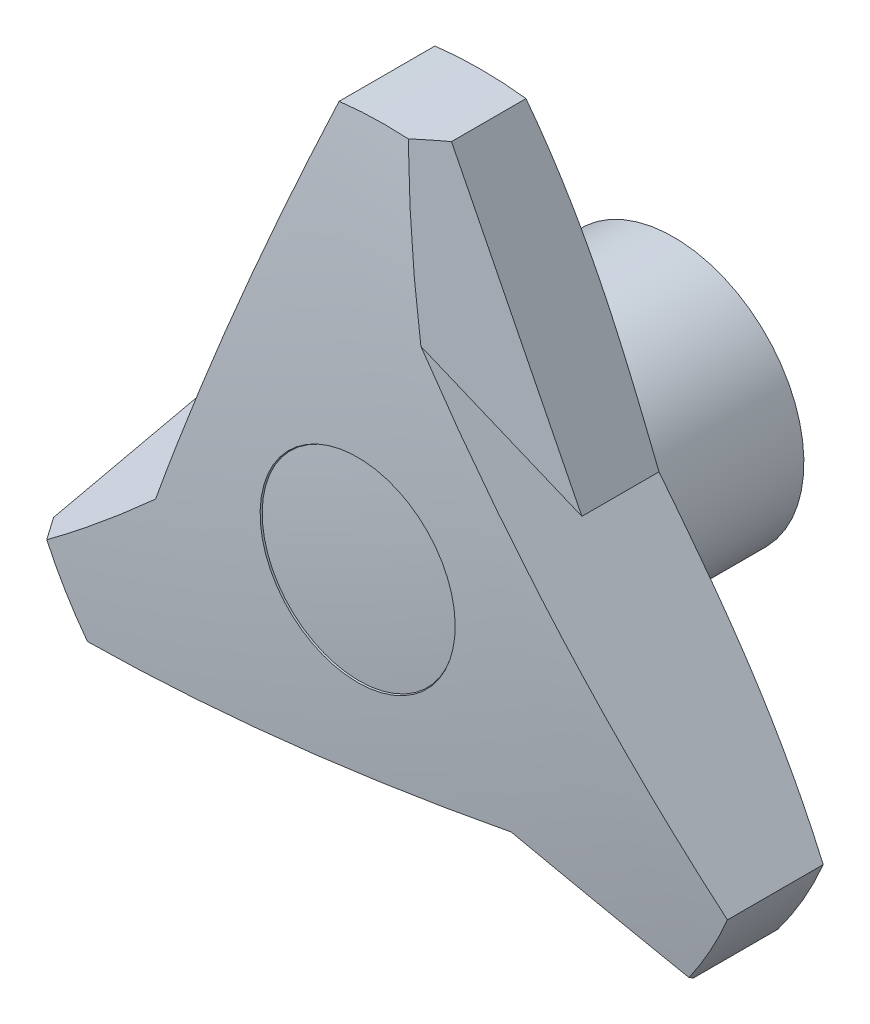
ISO-10303-21;
HEADER;
FILE_DESCRIPTION(('STEP AP214'),'2;1');
FILE_NAME('part.step','',(''),(''),'','','');
FILE_SCHEMA(('AUTOMOTIVE_DESIGN { 1 0 10303 214 1 1 1 1 }'));
ENDSEC;
DATA;
#1=APPLICATION_CONTEXT('core data for automotive mechanical design processes');
#2=APPLICATION_PROTOCOL_DEFINITION('international standard','automotive_design',2000,#1);
#3=PRODUCT_CONTEXT('',#1,'mechanical');
#4=PRODUCT('Part','Part','',(#3));
#5=PRODUCT_RELATED_PRODUCT_CATEGORY('part','',(#4));
#6=PRODUCT_DEFINITION_FORMATION('','',#4);
#7=PRODUCT_DEFINITION_CONTEXT('part definition',#1,'design');
#8=PRODUCT_DEFINITION('design','',#6,#7);
#9=PRODUCT_DEFINITION_SHAPE('','',#8);
#10=(LENGTH_UNIT() NAMED_UNIT(*) SI_UNIT(.MILLI.,.METRE.));
#11=(NAMED_UNIT(*) PLANE_ANGLE_UNIT() SI_UNIT($,.RADIAN.));
#12=(NAMED_UNIT(*) SI_UNIT($,.STERADIAN.) SOLID_ANGLE_UNIT());
#13=UNCERTAINTY_MEASURE_WITH_UNIT(LENGTH_MEASURE(1.E-05),#10,'distance_accuracy_value','');
#14=(GEOMETRIC_REPRESENTATION_CONTEXT(3) GLOBAL_UNCERTAINTY_ASSIGNED_CONTEXT((#13)) GLOBAL_UNIT_ASSIGNED_CONTEXT((#10,
#11,#12)) REPRESENTATION_CONTEXT('',''));
#15=CARTESIAN_POINT('',(0.,0.,0.));
#16=DIRECTION('',(0.,0.,1.));
#17=DIRECTION('',(1.,0.,0.));
#18=AXIS2_PLACEMENT_3D('',#15,#16,#17);
#19=CARTESIAN_POINT('',(0.,-9.85756615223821E-13,-147.000000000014));
#20=DIRECTION('',(0.,1.,0.));
#21=DIRECTION('',(1.,0.,0.));
#22=AXIS2_PLACEMENT_3D('',#19,#20,#21);
#23=SPHERICAL_SURFACE('',#22,190.);
#24=CARTESIAN_POINT('',(0.,0.,42.5547414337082));
#25=DIRECTION('',(0.,0.,1.));
#26=DIRECTION('',(0.,-1.,0.));
#27=AXIS2_PLACEMENT_3D('',#24,#25,#26);
#28=CIRCLE('',#27,13.);
#29=CARTESIAN_POINT('',(0.,-13.,42.5547414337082));
#30=VERTEX_POINT('',#29);
#31=EDGE_CURVE('E265',#30,#30,#28,.F.);
#32=ORIENTED_EDGE('',*,*,#31,.F.);
#33=EDGE_LOOP('',(#32));
#34=FACE_BOUND('',#33,.T.);
#35=ADVANCED_FACE('F15',(#34),#23,.T.);
#36=CARTESIAN_POINT('',(0.,0.,40.));
#37=DIRECTION('',(0.,0.,1.));
#38=DIRECTION('',(0.,-1.,0.));
#39=AXIS2_PLACEMENT_3D('',#36,#37,#38);
#40=CYLINDRICAL_SURFACE('',#39,13.);
#41=ORIENTED_EDGE('',*,*,#31,.T.);
#42=EDGE_LOOP('',(#41));
#43=FACE_BOUND('',#42,.T.);
#44=CARTESIAN_POINT('',(0.,0.,40.));
#45=DIRECTION('',(0.,0.,1.));
#46=DIRECTION('',(0.,-1.,0.));
#47=AXIS2_PLACEMENT_3D('',#44,#45,#46);
#48=CIRCLE('',#47,13.);
#49=CARTESIAN_POINT('',(0.,-13.,40.));
#50=VERTEX_POINT('',#49);
#51=EDGE_CURVE('E263',#50,#50,#48,.F.);
#52=ORIENTED_EDGE('',*,*,#51,.F.);
#53=EDGE_LOOP('',(#52));
#54=FACE_BOUND('',#53,.T.);
#55=ADVANCED_FACE('F608',(#43,#54),#40,.T.);
#56=CARTESIAN_POINT('',(0.,13.1,40.));
#57=DIRECTION('',(0.,0.,1.));
#58=DIRECTION('',(0.,-1.,0.));
#59=AXIS2_PLACEMENT_3D('',#56,#57,#58);
#60=PLANE('',#59);
#61=CARTESIAN_POINT('',(0.,0.,40.));
#62=DIRECTION('',(0.,0.,1.));
#63=DIRECTION('',(0.,-1.,0.));
#64=AXIS2_PLACEMENT_3D('',#61,#62,#63);
#65=CIRCLE('',#64,13.1);
#66=CARTESIAN_POINT('',(0.,-13.1,40.));
#67=VERTEX_POINT('',#66);
#68=EDGE_CURVE('E260',#67,#67,#65,.T.);
#69=ORIENTED_EDGE('',*,*,#68,.T.);
#70=EDGE_LOOP('',(#69));
#71=FACE_BOUND('',#70,.T.);
#72=ORIENTED_EDGE('',*,*,#51,.T.);
#73=EDGE_LOOP('',(#72));
#74=FACE_BOUND('',#73,.T.);
#75=ADVANCED_FACE('F431',(#71,#74),#60,.T.);
#76=CARTESIAN_POINT('',(8.4,0.,0.));
#77=DIRECTION('',(0.,0.,1.));
#78=DIRECTION('',(0.,-1.,0.));
#79=AXIS2_PLACEMENT_3D('',#76,#77,#78);
#80=PLANE('',#79);
#81=CARTESIAN_POINT('',(0.,0.,0.));
#82=DIRECTION('',(0.,0.,1.));
#83=DIRECTION('',(0.,-1.,0.));
#84=AXIS2_PLACEMENT_3D('',#81,#82,#83);
#85=CIRCLE('',#84,8.4);
#86=CARTESIAN_POINT('',(0.,-8.4,0.));
#87=VERTEX_POINT('',#86);
#88=EDGE_CURVE('E257',#87,#87,#85,.T.);
#89=ORIENTED_EDGE('',*,*,#88,.F.);
#90=EDGE_LOOP('',(#89));
#91=FACE_BOUND('',#90,.T.);
#92=CARTESIAN_POINT('',(0.,0.,0.));
#93=DIRECTION('',(0.,0.,-1.));
#94=DIRECTION('',(0.,1.,0.));
#95=AXIS2_PLACEMENT_3D('',#92,#93,#94);
#96=CIRCLE('',#95,5.99999999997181);
#97=CARTESIAN_POINT('',(0.,5.99999999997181,0.));
#98=VERTEX_POINT('',#97);
#99=EDGE_CURVE('E274',#98,#98,#96,.T.);
#100=ORIENTED_EDGE('',*,*,#99,.F.);
#101=EDGE_LOOP('',(#100));
#102=FACE_BOUND('',#101,.T.);
#103=ADVANCED_FACE('F428',(#91,#102),#80,.F.);
#104=CARTESIAN_POINT('',(0.,0.,40.));
#105=DIRECTION('',(0.,0.,1.));
#106=DIRECTION('',(0.,-1.,0.));
#107=AXIS2_PLACEMENT_3D('',#104,#105,#106);
#108=CYLINDRICAL_SURFACE('',#107,13.1);
#109=CARTESIAN_POINT('',(0.,0.,42.7342405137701));
#110=DIRECTION('',(0.,0.,1.));
#111=DIRECTION('',(0.,-1.,0.));
#112=AXIS2_PLACEMENT_3D('',#109,#110,#111);
#113=CIRCLE('',#112,13.1);
#114=CARTESIAN_POINT('',(0.,-13.1,42.7342405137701));
#115=VERTEX_POINT('',#114);
#116=EDGE_CURVE('E226',#115,#115,#113,.F.);
#117=ORIENTED_EDGE('',*,*,#116,.F.);
#118=EDGE_LOOP('',(#117));
#119=FACE_BOUND('',#118,.T.);
#120=ORIENTED_EDGE('',*,*,#68,.F.);
#121=EDGE_LOOP('',(#120));
#122=FACE_BOUND('',#121,.T.);
#123=ADVANCED_FACE('F425',(#119,#122),#108,.F.);
#124=CARTESIAN_POINT('',(0.,0.,0.));
#125=DIRECTION('',(0.,0.,1.));
#126=DIRECTION('',(0.,-1.,0.));
#127=AXIS2_PLACEMENT_3D('',#124,#125,#126);
#128=CYLINDRICAL_SURFACE('',#127,8.4);
#129=CARTESIAN_POINT('',(0.,0.,0.3));
#130=DIRECTION('',(0.,0.,1.));
#131=DIRECTION('',(0.,-1.,0.));
#132=AXIS2_PLACEMENT_3D('',#129,#130,#131);
#133=CIRCLE('',#132,8.4);
#134=CARTESIAN_POINT('',(0.,-8.4,0.3));
#135=VERTEX_POINT('',#134);
#136=EDGE_CURVE('E213',#135,#135,#133,.F.);
#137=ORIENTED_EDGE('',*,*,#136,.T.);
#138=EDGE_LOOP('',(#137));
#139=FACE_BOUND('',#138,.T.);
#140=ORIENTED_EDGE('',*,*,#88,.T.);
#141=EDGE_LOOP('',(#140));
#142=FACE_BOUND('',#141,.T.);
#143=ADVANCED_FACE('F250',(#139,#142),#128,.T.);
#144=CARTESIAN_POINT('',(27.7270975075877,8.91544882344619,27.7270975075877));
#145=DIRECTION('',(0.689509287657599,0.221706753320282,0.689509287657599));
#146=DIRECTION('',(-0.707106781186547,0.,0.707106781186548));
#147=AXIS2_PLACEMENT_3D('',#144,#145,#146);
#148=PLANE('',#147);
#149=DIRECTION('',(-0.583653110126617,0.733790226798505,0.347708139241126));
#150=VECTOR('',#149,1.);
#151=CARTESIAN_POINT('',(20.9107128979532,12.0728057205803,33.5282567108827));
#152=LINE('',#151,#150);
#153=CARTESIAN_POINT('',(20.9107128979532,12.0728057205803,33.5282567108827));
#154=VERTEX_POINT('',#153);
#155=CARTESIAN_POINT('',(7.35939895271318,29.110017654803,41.6013776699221));
#156=VERTEX_POINT('',#155);
#157=EDGE_CURVE('E208',#154,#156,#152,.T.);
#158=ORIENTED_EDGE('',*,*,#157,.F.);
#159=DIRECTION('',(0.365695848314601,-0.928304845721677,-0.0672061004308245));
#160=VECTOR('',#159,1.);
#161=CARTESIAN_POINT('',(6.11768916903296,49.6243274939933,36.2468586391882));
#162=LINE('',#161,#160);
#163=CARTESIAN_POINT('',(6.11768916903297,49.6243274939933,36.2468586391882));
#164=VERTEX_POINT('',#163);
#165=EDGE_CURVE('E104',#164,#154,#162,.T.);
#166=ORIENTED_EDGE('',*,*,#165,.F.);
#167=CARTESIAN_POINT('',(0.,0.,58.3208934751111));
#168=DIRECTION('',(0.689509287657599,0.221706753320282,0.689509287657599));
#169=DIRECTION('',(-0.656410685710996,-0.211064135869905,0.72427684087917));
#170=AXIS2_PLACEMENT_3D('',#167,#168,#169);
#171=ELLIPSE('',#170,72.5153393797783,50.);
#172=CARTESIAN_POINT('',(3.16952203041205,49.8994401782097,39.1065652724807));
#173=VERTEX_POINT('',#172);
#174=EDGE_CURVE('E210',#173,#164,#171,.F.);
#175=ORIENTED_EDGE('',*,*,#174,.F.);
#176=CARTESIAN_POINT('',(7.35939895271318,29.110017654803,41.6013776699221));
#177=CARTESIAN_POINT('',(7.22325188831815,29.6858443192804,41.552371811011));
#178=CARTESIAN_POINT('',(7.08873095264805,30.2619105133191,41.501662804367));
#179=CARTESIAN_POINT('',(6.82299189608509,31.414302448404,41.3968585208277));
#180=CARTESIAN_POINT('',(6.69177274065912,31.9906280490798,41.3427643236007));
#181=CARTESIAN_POINT('',(6.43263427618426,33.1435384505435,41.2311927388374));
#182=CARTESIAN_POINT('',(6.30471413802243,33.7201231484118,41.1737162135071));
#183=CARTESIAN_POINT('',(6.05217130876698,34.8735514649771,41.0553824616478));
#184=CARTESIAN_POINT('',(5.9275479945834,35.4503950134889,40.9945258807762));
#185=CARTESIAN_POINT('',(5.681597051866,36.6043408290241,40.8694338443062));
#186=CARTESIAN_POINT('',(5.56026900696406,37.1814430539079,40.8051988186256));
#187=CARTESIAN_POINT('',(5.32090745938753,38.3359060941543,40.6733510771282));
#188=CARTESIAN_POINT('',(5.20287374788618,38.9132668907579,40.6057385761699));
#189=CARTESIAN_POINT('',(4.9701003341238,40.0682470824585,40.4671364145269));
#190=CARTESIAN_POINT('',(4.85536063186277,40.6458664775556,40.3961467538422));
#191=CARTESIAN_POINT('',(4.6291753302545,41.801363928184,40.2507901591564));
#192=CARTESIAN_POINT('',(4.51772994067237,42.3792419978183,40.1764230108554));
#193=CARTESIAN_POINT('',(4.29813400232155,43.5352568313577,40.0243106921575));
#194=CARTESIAN_POINT('',(4.18998387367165,44.1133936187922,39.9465650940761));
#195=CARTESIAN_POINT('',(3.97697982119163,45.2699259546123,39.7876944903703));
#196=CARTESIAN_POINT('',(3.87212652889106,45.8483215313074,39.7065688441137));
#197=CARTESIAN_POINT('',(3.6657181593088,47.0053715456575,39.5409361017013));
#198=CARTESIAN_POINT('',(3.56416392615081,47.5840260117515,39.4564281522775));
#199=CARTESIAN_POINT('',(3.36435626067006,48.7415939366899,39.2840281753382));
#200=CARTESIAN_POINT('',(3.26610388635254,49.3205074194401,39.1961350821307));
#201=CARTESIAN_POINT('',(3.16952203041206,49.8994401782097,39.1065652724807));
#202=B_SPLINE_CURVE_WITH_KNOTS('',3,(#176,#177,#178,#179,#180,#181,#182,#183,#184,#185,#186,
#187,#188,#189,#190,#191,#192,#193,#194,#195,#196,#197,#198,#199,#200,#201),.UNSPECIFIED.,.F.,
.F.,(4,2,2,2,2,2,2,2,2,2,2,2,4),(0.,1.78118182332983,3.56179842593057,5.34196307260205,
7.12178883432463,8.90138865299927,10.6808754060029,12.4603621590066,14.2399619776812,
16.0197877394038,17.7999523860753,19.580568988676,21.3617508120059),.UNSPECIFIED.);
#203=EDGE_CURVE('E97',#156,#173,#202,.T.);
#204=ORIENTED_EDGE('',*,*,#203,.F.);
#205=EDGE_LOOP('',(#158,#166,#175,#204));
#206=FACE_BOUND('',#205,.T.);
#207=ADVANCED_FACE('F245',(#206),#148,.T.);
#208=CARTESIAN_POINT('',(-6.72657122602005,-28.4671747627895,28.016582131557));
#209=DIRECTION('',(-0.166072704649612,-0.702827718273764,0.691703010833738));
#210=DIRECTION('',(0.,-0.701443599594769,-0.712724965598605));
#211=AXIS2_PLACEMENT_3D('',#208,#209,#210);
#212=PLANE('',#211);
#213=DIRECTION('',(0.922166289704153,0.13779507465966,0.361416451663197));
#214=VECTOR('',#213,1.);
#215=CARTESIAN_POINT('',(0.,-24.1456114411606,34.0226487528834));
#216=LINE('',#215,#214);
#217=CARTESIAN_POINT('',(0.,-24.1456114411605,34.0226487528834));
#218=VERTEX_POINT('',#217);
#219=CARTESIAN_POINT('',(19.6035989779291,-21.216335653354,41.7057133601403));
#220=VERTEX_POINT('',#219);
#221=EDGE_CURVE('E333',#218,#220,#216,.T.);
#222=ORIENTED_EDGE('',*,*,#221,.F.);
#223=DIRECTION('',(-0.985272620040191,0.147224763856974,-0.086963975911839));
#224=VECTOR('',#223,1.);
#225=CARTESIAN_POINT('',(39.9170836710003,-30.1102379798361,37.5458850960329));
#226=LINE('',#225,#224);
#227=CARTESIAN_POINT('',(39.9170836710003,-30.1102379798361,37.5458850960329));
#228=VERTEX_POINT('',#227);
#229=EDGE_CURVE('E198',#228,#218,#226,.T.);
#230=ORIENTED_EDGE('',*,*,#229,.F.);
#231=CARTESIAN_POINT('',(40.8724756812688,-28.800012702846,39.1065652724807));
#232=CARTESIAN_POINT('',(40.8331343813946,-28.8558451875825,39.0403892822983));
#233=CARTESIAN_POINT('',(40.7936629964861,-28.9116193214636,38.9742413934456));
#234=CARTESIAN_POINT('',(40.7146174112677,-29.0228283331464,38.8422656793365));
#235=CARTESIAN_POINT('',(40.6750442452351,-29.0782636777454,38.7764376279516));
#236=CARTESIAN_POINT('',(40.5957979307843,-29.1887957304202,38.6451015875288));
#237=CARTESIAN_POINT('',(40.5561258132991,-29.2438929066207,38.5795933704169));
#238=CARTESIAN_POINT('',(40.4766844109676,-29.3537492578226,38.4488970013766));
#239=CARTESIAN_POINT('',(40.4369161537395,-29.4085089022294,38.3837086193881));
#240=CARTESIAN_POINT('',(40.357285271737,-29.5176908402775,38.2536519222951));
#241=CARTESIAN_POINT('',(40.3174236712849,-29.5721136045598,38.1887833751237));
#242=CARTESIAN_POINT('',(40.237608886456,-29.6806224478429,38.0593663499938));
#243=CARTESIAN_POINT('',(40.1976567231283,-29.7347089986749,37.9948176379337));
#244=CARTESIAN_POINT('',(40.117663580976,-29.8425460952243,37.8660402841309));
#245=CARTESIAN_POINT('',(40.0776236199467,-29.8962971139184,37.8018114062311));
#246=CARTESIAN_POINT('',(39.9974576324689,-30.003463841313,37.6736737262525));
#247=CARTESIAN_POINT('',(39.957332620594,-30.0568800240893,37.6097646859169));
#248=CARTESIAN_POINT('',(39.9170836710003,-30.1102379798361,37.5458850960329));
#249=B_SPLINE_CURVE_WITH_KNOTS('',3,(#231,#232,#233,#234,#235,#236,#237,#238,#239,#240,#241,
#242,#243,#244,#245,#246,#247,#248),.UNSPECIFIED.,.F.,.F.,(4,2,2,2,2,2,2,2,4),(0.,
0.285303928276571,0.569472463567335,0.852505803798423,1.13440414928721,1.41516770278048,
1.69479666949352,1.97329125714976,2.25065167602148),.UNSPECIFIED.);
#250=CARTESIAN_POINT('',(40.8724756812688,-28.8000127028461,39.1065652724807));
#251=VERTEX_POINT('',#250);
#252=EDGE_CURVE('E336',#251,#228,#249,.T.);
#253=ORIENTED_EDGE('',*,*,#252,.F.);
#254=CARTESIAN_POINT('',(19.6035989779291,-21.216335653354,41.7057133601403));
#255=CARTESIAN_POINT('',(20.2043265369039,-21.4066629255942,41.6565552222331));
#256=CARTESIAN_POINT('',(20.8043457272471,-21.5987264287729,41.6054628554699));
#257=CARTESIAN_POINT('',(22.0027065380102,-21.986241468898,41.4994328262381));
#258=CARTESIAN_POINT('',(22.6010486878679,-22.1816917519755,41.4444965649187));
#259=CARTESIAN_POINT('',(23.7960570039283,-22.5759767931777,41.3307827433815));
#260=CARTESIAN_POINT('',(24.3927236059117,-22.7748105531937,41.2720063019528));
#261=CARTESIAN_POINT('',(25.5843821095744,-23.1758596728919,41.1506153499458));
#262=CARTESIAN_POINT('',(26.1793743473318,-23.3780742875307,41.0880016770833));
#263=CARTESIAN_POINT('',(27.3676850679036,-23.785883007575,40.9589386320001));
#264=CARTESIAN_POINT('',(27.961003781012,-23.9914766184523,40.892489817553));
#265=CARTESIAN_POINT('',(29.1459680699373,-24.4060419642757,40.7557580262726));
#266=CARTESIAN_POINT('',(29.7376137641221,-24.6150134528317,40.6854753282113));
#267=CARTESIAN_POINT('',(30.9192323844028,-25.0363339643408,40.5410764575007));
#268=CARTESIAN_POINT('',(31.5092053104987,-25.2486829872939,40.4669602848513));
#269=CARTESIAN_POINT('',(32.687478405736,-25.6767587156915,40.3148943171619));
#270=CARTESIAN_POINT('',(33.2757784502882,-25.8924856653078,40.2369442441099));
#271=CARTESIAN_POINT('',(34.4507053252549,-26.3273180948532,40.0772095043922));
#272=CARTESIAN_POINT('',(35.0373319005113,-26.5464240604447,39.9954242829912));
#273=CARTESIAN_POINT('',(36.2089109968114,-26.9880160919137,39.8280174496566));
#274=CARTESIAN_POINT('',(36.7938631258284,-27.2105028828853,39.7423950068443));
#275=CARTESIAN_POINT('',(37.9620920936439,-27.6588588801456,39.567311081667));
#276=CARTESIAN_POINT('',(38.5453683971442,-27.8847290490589,39.4778484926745));
#277=CARTESIAN_POINT('',(39.7102441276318,-28.3398547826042,39.2950808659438));
#278=CARTESIAN_POINT('',(40.29184286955,-28.569111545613,39.2017744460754));
#279=CARTESIAN_POINT('',(40.8724756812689,-28.8000127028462,39.1065652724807));
#280=B_SPLINE_CURVE_WITH_KNOTS('',3,(#254,#255,#256,#257,#258,#259,#260,#261,#262,#263,#264,
#265,#266,#267,#268,#269,#270,#271,#272,#273,#274,#275,#276,#277,#278,#279),.UNSPECIFIED.,.F.,
.F.,(4,2,2,2,2,2,2,2,2,2,2,2,4),(0.,1.8962092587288,3.79173088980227,5.68670272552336,
7.58126232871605,9.47554708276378,11.3696942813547,13.2638414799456,15.1581262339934,
17.0526858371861,18.9476576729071,20.8431793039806,22.7393885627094),.UNSPECIFIED.);
#281=EDGE_CURVE('E229',#220,#251,#280,.T.);
#282=ORIENTED_EDGE('',*,*,#281,.F.);
#283=EDGE_LOOP('',(#222,#230,#253,#282));
#284=FACE_BOUND('',#283,.T.);
#285=ADVANCED_FACE('F241',(#284),#212,.T.);
#286=CARTESIAN_POINT('',(-21.2900109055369,20.0589689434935,28.016582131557));
#287=DIRECTION('',(-0.525630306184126,0.495237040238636,0.691703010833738));
#288=DIRECTION('',(-0.796197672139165,0.,-0.60503658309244));
#289=AXIS2_PLACEMENT_3D('',#286,#287,#288);
#290=PLANE('',#289);
#291=DIRECTION('',(-0.341749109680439,-0.867516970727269,0.36141645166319));
#292=VECTOR('',#291,1.);
#293=CARTESIAN_POINT('',(-20.9107128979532,12.0728057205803,34.0226487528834));
#294=LINE('',#293,#292);
#295=CARTESIAN_POINT('',(-20.9107128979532,12.0728057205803,34.0226487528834));
#296=VERTEX_POINT('',#295);
#297=CARTESIAN_POINT('',(-28.1756851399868,-6.36904689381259,41.7057133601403));
#298=VERTEX_POINT('',#297);
#299=EDGE_CURVE('E172',#296,#298,#294,.T.);
#300=ORIENTED_EDGE('',*,*,#299,.F.);
#301=DIRECTION('',(0.620136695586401,0.779658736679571,-0.086963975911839));
#302=VECTOR('',#301,1.);
#303=CARTESIAN_POINT('',(-46.0347728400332,-19.5140895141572,37.5458850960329));
#304=LINE('',#303,#302);
#305=CARTESIAN_POINT('',(-46.0347728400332,-19.5140895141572,37.5458850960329));
#306=VERTEX_POINT('',#305);
#307=EDGE_CURVE('E131',#306,#296,#304,.T.);
#308=ORIENTED_EDGE('',*,*,#307,.F.);
#309=CARTESIAN_POINT('',(-45.3777804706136,-20.9965959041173,39.1065652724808));
#310=CARTESIAN_POINT('',(-45.4064621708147,-20.93460909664,39.0403892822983));
#311=CARTESIAN_POINT('',(-45.4350282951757,-20.8725388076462,38.9742413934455));
#312=CARTESIAN_POINT('',(-45.4918153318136,-20.7484788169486,38.8422656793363));
#313=CARTESIAN_POINT('',(-45.5200371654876,-20.6864897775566,38.7764376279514));
#314=CARTESIAN_POINT('',(-45.576137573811,-20.5625944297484,38.6451015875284));
#315=CARTESIAN_POINT('',(-45.6040170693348,-20.5006887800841,38.5795933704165));
#316=CARTESIAN_POINT('',(-45.659434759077,-20.3769623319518,38.4488970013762));
#317=CARTESIAN_POINT('',(-45.6869738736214,-20.3151421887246,38.3837086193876));
#318=CARTESIAN_POINT('',(-45.7417127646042,-20.1915888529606,38.2536519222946));
#319=CARTESIAN_POINT('',(-45.7689134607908,-20.1298563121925,38.1887833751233));
#320=CARTESIAN_POINT('',(-45.8229774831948,-20.0064802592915,38.0593663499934));
#321=CARTESIAN_POINT('',(-45.8498417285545,-19.9448373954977,37.9948176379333));
#322=CARTESIAN_POINT('',(-45.9032348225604,-19.8216427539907,37.8660402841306));
#323=CARTESIAN_POINT('',(-45.9297645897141,-19.7600916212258,37.8018114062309));
#324=CARTESIAN_POINT('',(-45.9824907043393,-19.6370824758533,37.6736737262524));
#325=CARTESIAN_POINT('',(-46.0086879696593,-19.5756251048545,37.6097646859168));
#326=CARTESIAN_POINT('',(-46.0347728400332,-19.5140895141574,37.5458850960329));
#327=B_SPLINE_CURVE_WITH_KNOTS('',3,(#309,#310,#311,#312,#313,#314,#315,#316,#317,#318,#319,
#320,#321,#322,#323,#324,#325,#326),.UNSPECIFIED.,.F.,.F.,(4,2,2,2,2,2,2,2,4),(0.,
0.285303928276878,0.56947246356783,0.852505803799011,1.13440414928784,1.41516770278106,
1.69479666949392,1.97329125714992,2.25065167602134),.UNSPECIFIED.);
#328=CARTESIAN_POINT('',(-45.3777804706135,-20.9965959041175,39.1065652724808));
#329=VERTEX_POINT('',#328);
#330=EDGE_CURVE('E299',#329,#306,#327,.T.);
#331=ORIENTED_EDGE('',*,*,#330,.F.);
#332=CARTESIAN_POINT('',(-28.1756851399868,-6.36904689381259,41.7057133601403));
#333=CARTESIAN_POINT('',(-28.6408771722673,-6.79412858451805,41.6565552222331));
#334=CARTESIAN_POINT('',(-29.1072186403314,-7.21772869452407,41.6054628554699));
#335=CARTESIAN_POINT('',(-30.0419969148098,-8.06178207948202,41.4994328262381));
#336=CARTESIAN_POINT('',(-30.5104329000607,-8.48223643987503,41.4444965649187));
#337=CARTESIAN_POINT('',(-31.4493979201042,-9.32000147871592,41.3307827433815));
#338=CARTESIAN_POINT('',(-31.9199263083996,-9.73731303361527,41.2720063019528));
#339=CARTESIAN_POINT('',(-32.863074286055,-10.5687950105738,41.1506153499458));
#340=CARTESIAN_POINT('',(-33.3356933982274,-10.9829660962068,41.0880016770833));
#341=CARTESIAN_POINT('',(-34.2830214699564,-11.8081690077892,40.9589386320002));
#342=CARTESIAN_POINT('',(-34.7577301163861,-12.2192012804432,40.8924898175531));
#343=CARTESIAN_POINT('',(-35.7092363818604,-13.0381277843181,40.7557580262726));
#344=CARTESIAN_POINT('',(-36.186033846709,-13.4460222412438,40.6854753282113));
#345=CARTESIAN_POINT('',(-37.1417174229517,-14.258673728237,40.5410764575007));
#346=CARTESIAN_POINT('',(-37.6206035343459,-14.6634307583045,40.4669602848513));
#347=CARTESIAN_POINT('',(-38.5804645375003,-15.469807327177,40.3148943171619));
#348=CARTESIAN_POINT('',(-39.061439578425,-15.8714266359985,40.23694424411));
#349=CARTESIAN_POINT('',(-40.0254789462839,-16.6715269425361,40.0772095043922));
#350=CARTESIAN_POINT('',(-40.5085435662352,-17.0700074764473,39.9954242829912));
#351=CARTESIAN_POINT('',(-41.4767630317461,-17.8638287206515,39.8280174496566));
#352=CARTESIAN_POINT('',(-41.9619183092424,-18.2591687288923,39.7423950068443));
#353=CARTESIAN_POINT('',(-42.9343204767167,-19.0467066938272,39.5673110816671));
#354=CARTESIAN_POINT('',(-43.4215679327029,-19.4389037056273,39.4778484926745));
#355=CARTESIAN_POINT('',(-44.398156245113,-20.2201528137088,39.2950808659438));
#356=CARTESIAN_POINT('',(-44.8874977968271,-20.6092037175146,39.2017744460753));
#357=CARTESIAN_POINT('',(-45.3777804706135,-20.9965959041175,39.1065652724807));
#358=B_SPLINE_CURVE_WITH_KNOTS('',3,(#332,#333,#334,#335,#336,#337,#338,#339,#340,#341,#342,
#343,#344,#345,#346,#347,#348,#349,#350,#351,#352,#353,#354,#355,#356,#357),.UNSPECIFIED.,.F.,
.F.,(4,2,2,2,2,2,2,2,2,2,2,2,4),(0.,1.89620925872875,3.79173088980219,5.68670272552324,
7.58126232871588,9.47554708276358,11.3696942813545,13.2638414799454,15.158126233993,
17.0526858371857,18.9476576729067,20.8431793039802,22.7393885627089),.UNSPECIFIED.);
#359=EDGE_CURVE('E235',#298,#329,#358,.T.);
#360=ORIENTED_EDGE('',*,*,#359,.F.);
#361=EDGE_LOOP('',(#300,#308,#331,#360));
#362=FACE_BOUND('',#361,.T.);
#363=ADVANCED_FACE('F183',(#362),#290,.T.);
#364=CARTESIAN_POINT('',(-1.11022302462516E-13,0.,-280.));
#365=DIRECTION('',(-1.,0.,0.));
#366=DIRECTION('',(0.,0.,1.));
#367=AXIS2_PLACEMENT_3D('',#364,#365,#366);
#368=SPHERICAL_SURFACE('',#367,323.);
#369=ORIENTED_EDGE('',*,*,#116,.T.);
#370=EDGE_LOOP('',(#369));
#371=FACE_BOUND('',#370,.T.);
#372=CARTESIAN_POINT('',(19.6035989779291,-21.216335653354,41.7057133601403));
#373=CARTESIAN_POINT('',(17.9447015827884,-21.4642170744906,41.7904541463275));
#374=CARTESIAN_POINT('',(16.2851486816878,-21.7121964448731,41.8620748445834));
#375=CARTESIAN_POINT('',(12.9671565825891,-22.2079887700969,41.9789924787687));
#376=CARTESIAN_POINT('',(11.3087184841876,-22.4558015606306,42.0243213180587));
#377=CARTESIAN_POINT('',(7.99295683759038,-22.951260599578,42.0887464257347));
#378=CARTESIAN_POINT('',(6.33563377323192,-23.1989067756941,42.1078681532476));
#379=CARTESIAN_POINT('',(3.02210283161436,-23.6940324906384,42.119952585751));
#380=CARTESIAN_POINT('',(1.36589502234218,-23.9415120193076,42.1129343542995));
#381=CARTESIAN_POINT('',(-1.94540505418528,-24.4363043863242,42.0727927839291));
#382=CARTESIAN_POINT('',(-3.60049747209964,-24.6836172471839,42.0396821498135));
#383=CARTESIAN_POINT('',(-6.90956667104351,-25.178076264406,41.947390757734));
#384=CARTESIAN_POINT('',(-8.56354362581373,-25.4252224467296,41.8882163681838));
#385=CARTESIAN_POINT('',(-11.8703846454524,-25.9193485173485,41.7438132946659));
#386=CARTESIAN_POINT('',(-13.5232487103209,-26.1663284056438,41.6585846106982));
#387=CARTESIAN_POINT('',(-16.8278660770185,-26.6601222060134,41.4620696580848));
#388=CARTESIAN_POINT('',(-18.4796190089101,-26.9069360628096,41.3507770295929));
#389=CARTESIAN_POINT('',(-21.782012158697,-27.4003975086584,41.1021119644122));
#390=CARTESIAN_POINT('',(-23.4326514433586,-27.6470449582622,40.9647268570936));
#391=CARTESIAN_POINT('',(-26.7328138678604,-28.1401730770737,40.663835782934));
#392=CARTESIAN_POINT('',(-28.3823353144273,-28.3866534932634,40.5003108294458));
#393=CARTESIAN_POINT('',(-31.6802570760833,-28.8794468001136,40.1470795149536));
#394=CARTESIAN_POINT('',(-33.3286547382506,-29.1257592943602,39.9573478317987));
#395=CARTESIAN_POINT('',(-36.6243226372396,-29.6182158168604,39.5516250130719));
#396=CARTESIAN_POINT('',(-38.2715890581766,-29.8643592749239,39.3356021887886));
#397=CARTESIAN_POINT('',(-39.9170836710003,-30.1102379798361,39.1065652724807));
#398=B_SPLINE_CURVE_WITH_KNOTS('',3,(#372,#373,#374,#375,#376,#377,#378,#379,#380,#381,#382,
#383,#384,#385,#386,#387,#388,#389,#390,#391,#392,#393,#394,#395,#396,#397),.UNSPECIFIED.,.F.,
.F.,(4,2,2,2,2,2,2,2,2,2,2,2,4),(0.,5.03831143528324,10.0704963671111,15.0977892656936,
20.1214165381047,25.1425992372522,30.1625557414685,35.1825122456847,40.2036949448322,
45.2273222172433,50.2546151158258,55.2868000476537,60.3251114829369),.UNSPECIFIED.);
#399=CARTESIAN_POINT('',(-39.9170836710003,-30.1102379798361,39.1065652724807));
#400=VERTEX_POINT('',#399);
#401=EDGE_CURVE('E327',#220,#400,#398,.T.);
#402=ORIENTED_EDGE('',*,*,#401,.F.);
#403=ORIENTED_EDGE('',*,*,#281,.T.);
#404=CARTESIAN_POINT('',(0.,0.,39.1065652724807));
#405=DIRECTION('',(0.,0.,1.));
#406=DIRECTION('',(0.,-1.,0.));
#407=AXIS2_PLACEMENT_3D('',#404,#405,#406);
#408=CIRCLE('',#407,50.);
#409=CARTESIAN_POINT('',(46.0347728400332,-19.5140895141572,39.1065652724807));
#410=VERTEX_POINT('',#409);
#411=EDGE_CURVE('E334',#410,#251,#408,.F.);
#412=ORIENTED_EDGE('',*,*,#411,.F.);
#413=CARTESIAN_POINT('',(7.35939895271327,29.110017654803,41.6013776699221));
#414=CARTESIAN_POINT('',(8.43709360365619,27.7551001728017,41.6993589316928));
#415=CARTESIAN_POINT('',(9.51528080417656,26.3995634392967,41.7833580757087));
#416=CARTESIAN_POINT('',(11.6709614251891,23.6893622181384,41.9232852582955));
#417=CARTESIAN_POINT('',(12.7484539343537,22.33469887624,41.9792495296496));
#418=CARTESIAN_POINT('',(14.9027442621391,19.6262455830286,42.0632105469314));
#419=CARTESIAN_POINT('',(15.9795416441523,18.2724561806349,42.0912362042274));
#420=CARTESIAN_POINT('',(18.1324410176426,15.5657516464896,42.1194035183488));
#421=CARTESIAN_POINT('',(19.208542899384,14.2128366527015,42.1195668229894));
#422=CARTESIAN_POINT('',(21.3600508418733,11.5078814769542,42.0920706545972));
#423=CARTESIAN_POINT('',(22.4354569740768,10.1558412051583,42.064425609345));
#424=CARTESIAN_POINT('',(24.5855732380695,7.45263569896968,41.9813524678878));
#425=CARTESIAN_POINT('',(25.6602834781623,6.10147032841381,41.9259316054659));
#426=CARTESIAN_POINT('',(27.809009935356,3.40001213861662,41.7873248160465));
#427=CARTESIAN_POINT('',(28.883026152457,2.0497193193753,41.7041388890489));
#428=CARTESIAN_POINT('',(31.0303661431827,-0.649995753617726,41.5099982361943));
#429=CARTESIAN_POINT('',(32.1036896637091,-1.99941768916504,41.3990362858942));
#430=CARTESIAN_POINT('',(34.2496428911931,-4.69738927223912,41.1493183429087));
#431=CARTESIAN_POINT('',(35.3222719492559,-6.04593810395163,41.0105479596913));
#432=CARTESIAN_POINT('',(37.4668338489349,-8.74216045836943,40.7051665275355));
#433=CARTESIAN_POINT('',(38.5387655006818,-10.0898324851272,40.5385339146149));
#434=CARTESIAN_POINT('',(40.6819290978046,-12.7842968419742,40.177359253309));
#435=CARTESIAN_POINT('',(41.7531591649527,-14.1310868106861,39.9827884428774));
#436=CARTESIAN_POINT('',(43.8949151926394,-16.8237815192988,39.5656487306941));
#437=CARTESIAN_POINT('',(44.9654384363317,-18.1696828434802,39.3430438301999));
#438=CARTESIAN_POINT('',(46.0347728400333,-19.5140895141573,39.1065652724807));
#439=B_SPLINE_CURVE_WITH_KNOTS('',3,(#413,#414,#415,#416,#417,#418,#419,#420,#421,#422,#423,
#424,#425,#426,#427,#428,#429,#430,#431,#432,#433,#434,#435,#436,#437,#438),.UNSPECIFIED.,.F.,
.F.,(4,2,2,2,2,2,2,2,2,2,2,2,4),(0.,5.20200515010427,10.397269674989,15.5871524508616,
20.7730028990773,25.9561641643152,31.1379762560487,36.3197883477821,41.50294961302,
46.6888000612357,51.8786828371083,57.073947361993,62.2759525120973),.UNSPECIFIED.);
#440=EDGE_CURVE('E216',#156,#410,#439,.T.);
#441=ORIENTED_EDGE('',*,*,#440,.F.);
#442=ORIENTED_EDGE('',*,*,#203,.T.);
#443=CARTESIAN_POINT('',(0.,0.,39.1065652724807));
#444=DIRECTION('',(0.,0.,1.));
#445=DIRECTION('',(0.,-1.,0.));
#446=AXIS2_PLACEMENT_3D('',#443,#444,#445);
#447=CIRCLE('',#446,50.);
#448=CARTESIAN_POINT('',(-6.11768916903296,49.6243274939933,39.1065652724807));
#449=VERTEX_POINT('',#448);
#450=EDGE_CURVE('E211',#449,#173,#447,.F.);
#451=ORIENTED_EDGE('',*,*,#450,.F.);
#452=CARTESIAN_POINT('',(-28.1756851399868,-6.36904689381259,41.7057133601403));
#453=CARTESIAN_POINT('',(-27.5609080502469,-4.80845889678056,41.7904541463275));
#454=CARTESIAN_POINT('',(-26.9458880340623,-3.24725424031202,41.8620748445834));
#455=CARTESIAN_POINT('',(-25.7162607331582,-0.125892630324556,41.9789924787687));
#456=CARTESIAN_POINT('',(-25.1016538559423,1.43426328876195,42.0243213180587));
#457=CARTESIAN_POINT('',(-23.8728531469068,4.55352662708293,42.0887464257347));
#458=CARTESIAN_POINT('',(-23.2586594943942,6.11263359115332,42.1078681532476));
#459=CARTESIAN_POINT('',(-22.0306854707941,9.22979842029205,42.119952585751));
#460=CARTESIAN_POINT('',(-21.4169051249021,10.7878562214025,42.1129343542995));
#461=CARTESIAN_POINT('',(-20.1897578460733,13.902922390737,42.0727927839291));
#462=CARTESIAN_POINT('',(-19.5763908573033,15.4599309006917,42.0396821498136));
#463=CARTESIAN_POINT('',(-18.350070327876,18.5728983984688,41.9473907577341));
#464=CARTESIAN_POINT('',(-17.7371167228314,20.1288575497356,41.8882163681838));
#465=CARTESIAN_POINT('',(-16.5116219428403,23.2397289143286,41.7438132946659));
#466=CARTESIAN_POINT('',(-15.8990807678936,24.7946411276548,41.6585846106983));
#467=CARTESIAN_POINT('',(-14.6744100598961,27.9034206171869,41.4620696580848));
#468=CARTESIAN_POINT('',(-14.0622806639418,29.4572875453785,41.3507770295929));
#469=CARTESIAN_POINT('',(-12.8384342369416,32.5639746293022,41.1021119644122));
#470=CARTESIAN_POINT('',(-12.2267175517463,34.1167939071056,40.9647268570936));
#471=CARTESIAN_POINT('',(-11.0036978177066,37.2213824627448,40.663835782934));
#472=CARTESIAN_POINT('',(-10.3923953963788,38.7731501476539,40.5003108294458));
#473=CARTESIAN_POINT('',(-9.17020603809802,41.8756308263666,40.1470795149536));
#474=CARTESIAN_POINT('',(-8.55932008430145,43.4263413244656,39.9573478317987));
#475=CARTESIAN_POINT('',(-7.33796599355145,46.5267017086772,39.5516250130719));
#476=CARTESIAN_POINT('',(-6.7274992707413,48.0763480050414,39.3356021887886));
#477=CARTESIAN_POINT('',(-6.117689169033,49.6243274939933,39.1065652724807));
#478=B_SPLINE_CURVE_WITH_KNOTS('',3,(#452,#453,#454,#455,#456,#457,#458,#459,#460,#461,#462,
#463,#464,#465,#466,#467,#468,#469,#470,#471,#472,#473,#474,#475,#476,#477),.UNSPECIFIED.,.F.,
.F.,(4,2,2,2,2,2,2,2,2,2,2,2,4),(0.,5.03831143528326,10.0704963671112,15.0977892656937,
20.1214165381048,25.1425992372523,30.1625557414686,35.1825122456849,40.2036949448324,
45.2273222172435,50.254615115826,55.2868000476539,60.3251114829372),.UNSPECIFIED.);
#479=EDGE_CURVE('E130',#298,#449,#478,.T.);
#480=ORIENTED_EDGE('',*,*,#479,.F.);
#481=ORIENTED_EDGE('',*,*,#359,.T.);
#482=CARTESIAN_POINT('',(0.,0.,39.1065652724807));
#483=DIRECTION('',(0.,0.,1.));
#484=DIRECTION('',(0.,-1.,0.));
#485=AXIS2_PLACEMENT_3D('',#482,#483,#484);
#486=CIRCLE('',#485,50.);
#487=EDGE_CURVE('E174',#400,#329,#486,.F.);
#488=ORIENTED_EDGE('',*,*,#487,.F.);
#489=EDGE_LOOP('',(#402,#403,#412,#441,#442,#451,#480,#481,#488));
#490=FACE_BOUND('',#489,.T.);
#491=ADVANCED_FACE('F176',(#371,#490),#368,.T.);
#492=CARTESIAN_POINT('',(17.5,0.,0.3));
#493=DIRECTION('',(0.,0.,1.));
#494=DIRECTION('',(0.,-1.,0.));
#495=AXIS2_PLACEMENT_3D('',#492,#493,#494);
#496=PLANE('',#495);
#497=CARTESIAN_POINT('',(0.,0.,0.3));
#498=DIRECTION('',(0.,0.,1.));
#499=DIRECTION('',(0.,-1.,0.));
#500=AXIS2_PLACEMENT_3D('',#497,#498,#499);
#501=CIRCLE('',#500,17.5);
#502=CARTESIAN_POINT('',(0.,-17.5,0.3));
#503=VERTEX_POINT('',#502);
#504=EDGE_CURVE('E123',#503,#503,#501,.T.);
#505=ORIENTED_EDGE('',*,*,#504,.F.);
#506=EDGE_LOOP('',(#505));
#507=FACE_BOUND('',#506,.T.);
#508=ORIENTED_EDGE('',*,*,#136,.F.);
#509=EDGE_LOOP('',(#508));
#510=FACE_BOUND('',#509,.T.);
#511=ADVANCED_FACE('F182',(#507,#510),#496,.F.);
#512=CARTESIAN_POINT('',(0.,0.,43.));
#513=DIRECTION('',(0.,0.,1.));
#514=DIRECTION('',(0.,-1.,0.));
#515=AXIS2_PLACEMENT_3D('',#512,#513,#514);
#516=CYLINDRICAL_SURFACE('',#515,50.);
#517=CARTESIAN_POINT('',(0.,0.,26.2412362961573));
#518=DIRECTION('',(0.,0.,-1.));
#519=DIRECTION('',(1.,0.,0.));
#520=AXIS2_PLACEMENT_3D('',#517,#518,#519);
#521=CIRCLE('',#520,50.);
#522=CARTESIAN_POINT('',(-6.11768916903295,49.6243274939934,26.2412362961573));
#523=VERTEX_POINT('',#522);
#524=CARTESIAN_POINT('',(6.11768916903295,49.6243274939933,26.2412362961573));
#525=VERTEX_POINT('',#524);
#526=EDGE_CURVE('E111',#523,#525,#521,.T.);
#527=ORIENTED_EDGE('',*,*,#526,.F.);
#528=DIRECTION('',(0.,0.,1.));
#529=VECTOR('',#528,1.);
#530=CARTESIAN_POINT('',(-6.11768916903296,49.6243274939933,0.));
#531=LINE('',#530,#529);
#532=EDGE_CURVE('E115',#449,#523,#531,.F.);
#533=ORIENTED_EDGE('',*,*,#532,.F.);
#534=ORIENTED_EDGE('',*,*,#450,.T.);
#535=ORIENTED_EDGE('',*,*,#174,.T.);
#536=DIRECTION('',(0.,0.,1.));
#537=VECTOR('',#536,1.);
#538=CARTESIAN_POINT('',(6.11768916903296,49.6243274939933,0.));
#539=LINE('',#538,#537);
#540=EDGE_CURVE('E117',#525,#164,#539,.T.);
#541=ORIENTED_EDGE('',*,*,#540,.F.);
#542=EDGE_LOOP('',(#527,#533,#534,#535,#541));
#543=FACE_BOUND('',#542,.T.);
#544=ADVANCED_FACE('F113',(#543),#516,.T.);
#545=CARTESIAN_POINT('',(22.2186009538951,8.75278219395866,0.));
#546=DIRECTION('',(0.930408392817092,0.366524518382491,0.));
#547=DIRECTION('',(-0.366524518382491,0.930408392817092,0.));
#548=AXIS2_PLACEMENT_3D('',#545,#546,#547);
#549=PLANE('',#548);
#550=DIRECTION('',(0.,0.,1.));
#551=VECTOR('',#550,1.);
#552=CARTESIAN_POINT('',(20.9107128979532,12.0728057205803,0.));
#553=LINE('',#552,#551);
#554=CARTESIAN_POINT('',(20.9107128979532,12.0728057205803,23.173878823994));
#555=VERTEX_POINT('',#554);
#556=EDGE_CURVE('E205',#555,#154,#553,.T.);
#557=ORIENTED_EDGE('',*,*,#556,.F.);
#558=CARTESIAN_POINT('',(6.11768916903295,49.6243274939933,26.2412362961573));
#559=CARTESIAN_POINT('',(6.42222643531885,48.8512713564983,26.0792194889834));
#560=CARTESIAN_POINT('',(6.72729015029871,48.0768788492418,25.9245965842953));
#561=CARTESIAN_POINT('',(7.33835523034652,46.5257136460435,25.6299087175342));
#562=CARTESIAN_POINT('',(7.64435657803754,45.7489409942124,25.4898434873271));
#563=CARTESIAN_POINT('',(8.25713969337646,44.193414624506,25.2240582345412));
#564=CARTESIAN_POINT('',(8.56392131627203,43.4146612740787,25.0983357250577));
#565=CARTESIAN_POINT('',(9.17821273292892,41.8553061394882,24.8609024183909));
#566=CARTESIAN_POINT('',(9.48572252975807,41.0747043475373,24.7491916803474));
#567=CARTESIAN_POINT('',(10.1006056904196,39.5138470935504,24.5396705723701));
#568=CARTESIAN_POINT('',(10.407977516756,38.7335955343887,24.4418265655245));
#569=CARTESIAN_POINT('',(11.0232445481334,37.1717638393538,24.2592619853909));
#570=CARTESIAN_POINT('',(11.3311397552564,36.3901836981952,24.1745414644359));
#571=CARTESIAN_POINT('',(11.9473621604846,34.8259268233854,24.0176785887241));
#572=CARTESIAN_POINT('',(12.2556893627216,34.0432500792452,23.945536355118));
#573=CARTESIAN_POINT('',(12.8726828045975,32.4770359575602,23.8131766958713));
#574=CARTESIAN_POINT('',(13.1813490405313,31.6934985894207,23.7529591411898));
#575=CARTESIAN_POINT('',(13.7984485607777,30.1270151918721,23.6437555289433));
#576=CARTESIAN_POINT('',(14.1068814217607,29.3440702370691,23.5947515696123));
#577=CARTESIAN_POINT('',(14.7239395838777,27.7776918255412,23.5069378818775));
#578=CARTESIAN_POINT('',(15.0325648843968,26.9942583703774,23.4681281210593));
#579=CARTESIAN_POINT('',(15.6499724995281,25.4269928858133,23.3996424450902));
#580=CARTESIAN_POINT('',(15.9587548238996,24.6431608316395,23.3699671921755));
#581=CARTESIAN_POINT('',(16.5764065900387,23.0752755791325,23.3185577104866));
#582=CARTESIAN_POINT('',(16.8852760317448,22.2912223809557,23.2968234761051));
#583=CARTESIAN_POINT('',(17.5038704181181,20.7209443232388,23.2599380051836));
#584=CARTESIAN_POINT('',(17.8135954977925,19.9347191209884,23.2448040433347));
#585=CARTESIAN_POINT('',(18.4330748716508,18.3621945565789,23.2198229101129));
#586=CARTESIAN_POINT('',(18.7428291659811,17.5758951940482,23.2099757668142));
#587=CARTESIAN_POINT('',(19.3622722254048,16.0034628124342,23.1942220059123));
#588=CARTESIAN_POINT('',(19.6719609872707,15.2173298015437,23.1883143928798));
#589=CARTESIAN_POINT('',(20.1364947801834,14.0381286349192,23.1815210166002));
#590=CARTESIAN_POINT('',(20.2913379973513,13.6450650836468,23.1796012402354));
#591=CARTESIAN_POINT('',(20.6010250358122,12.8589364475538,23.1763370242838));
#592=CARTESIAN_POINT('',(20.755868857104,12.465871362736,23.1749925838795));
#593=CARTESIAN_POINT('',(20.9107128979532,12.0728057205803,23.173878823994));
#594=B_SPLINE_CURVE_WITH_KNOTS('',3,(#558,#559,#560,#561,#562,#563,#564,#565,#566,#567,#568,
#569,#570,#571,#572,#573,#574,#575,#576,#577,#578,#579,#580,#581,#582,#583,#584,#585,#586,#587,
#588,#589,#590,#591,#592,#593),.UNSPECIFIED.,.F.,.F.,(4,2,2,2,2,2,2,2,2,2,2,2,2,2,2,2,2,4),(0.,
2.5395401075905,5.07903343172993,7.61808575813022,10.1571488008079,12.689943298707,
15.2227478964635,17.7555768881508,20.2883784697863,22.8171079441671,25.3458293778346,
27.8747340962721,30.4036370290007,32.9391196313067,35.4746156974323,38.0094708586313,
39.2768740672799,40.5442754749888),.UNSPECIFIED.);
#595=EDGE_CURVE('E122',#525,#555,#594,.T.);
#596=ORIENTED_EDGE('',*,*,#595,.F.);
#597=ORIENTED_EDGE('',*,*,#540,.T.);
#598=ORIENTED_EDGE('',*,*,#165,.T.);
#599=EDGE_LOOP('',(#557,#596,#597,#598));
#600=FACE_BOUND('',#599,.T.);
#601=ADVANCED_FACE('F364',(#600),#549,.T.);
#602=CARTESIAN_POINT('',(18.6894322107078,14.865481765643,0.));
#603=DIRECTION('',(0.782623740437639,0.622495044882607,0.));
#604=DIRECTION('',(-0.622495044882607,0.782623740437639,0.));
#605=AXIS2_PLACEMENT_3D('',#602,#603,#604);
#606=PLANE('',#605);
#607=ORIENTED_EDGE('',*,*,#157,.T.);
#608=ORIENTED_EDGE('',*,*,#440,.T.);
#609=DIRECTION('',(0.,0.,1.));
#610=VECTOR('',#609,1.);
#611=CARTESIAN_POINT('',(46.0347728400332,-19.5140895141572,43.));
#612=LINE('',#611,#610);
#613=CARTESIAN_POINT('',(46.0347728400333,-19.5140895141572,26.2412362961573));
#614=VERTEX_POINT('',#613);
#615=EDGE_CURVE('E339',#614,#410,#612,.T.);
#616=ORIENTED_EDGE('',*,*,#615,.F.);
#617=CARTESIAN_POINT('',(20.9107128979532,12.0728057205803,23.173878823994));
#618=CARTESIAN_POINT('',(21.2245349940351,11.678257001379,23.1752107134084));
#619=CARTESIAN_POINT('',(21.5383565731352,11.2837089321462,23.176866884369));
#620=CARTESIAN_POINT('',(22.165998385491,10.494614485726,23.1810303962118));
#621=CARTESIAN_POINT('',(22.4798186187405,10.1000681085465,23.1835377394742));
#622=CARTESIAN_POINT('',(23.4212988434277,8.91640442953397,23.1926406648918));
#623=CARTESIAN_POINT('',(24.0489537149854,8.12729356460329,23.200817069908));
#624=CARTESIAN_POINT('',(25.3045441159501,6.54871898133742,23.2235002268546));
#625=CARTESIAN_POINT('',(25.9324796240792,5.7592552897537,23.2380102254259));
#626=CARTESIAN_POINT('',(27.1882462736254,4.18045912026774,23.2757086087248));
#627=CARTESIAN_POINT('',(27.8160774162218,3.39112664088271,23.2988968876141));
#628=CARTESIAN_POINT('',(29.0694374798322,1.81535612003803,23.3561469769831));
#629=CARTESIAN_POINT('',(29.6949670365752,1.02891727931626,23.3901719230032));
#630=CARTESIAN_POINT('',(30.945709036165,-0.543561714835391,23.471177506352));
#631=CARTESIAN_POINT('',(31.5709214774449,-1.3296018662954,23.5181582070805));
#632=CARTESIAN_POINT('',(32.8207324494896,-2.90091033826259,23.626844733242));
#633=CARTESIAN_POINT('',(33.4453310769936,-3.68617878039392,23.6885476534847));
#634=CARTESIAN_POINT('',(34.6938192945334,-5.25582423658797,23.8281669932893));
#635=CARTESIAN_POINT('',(35.3177088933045,-6.04020126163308,23.9060832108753));
#636=CARTESIAN_POINT('',(36.7866107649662,-7.88695889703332,24.1102198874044));
#637=CARTESIAN_POINT('',(37.6312356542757,-8.94885247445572,24.2437606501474));
#638=CARTESIAN_POINT('',(39.3181240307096,-11.0696707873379,24.5453016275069));
#639=CARTESIAN_POINT('',(40.1603874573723,-12.1285954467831,24.7133027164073));
#640=CARTESIAN_POINT('',(41.8436594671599,-14.244867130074,25.0858940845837));
#641=CARTESIAN_POINT('',(42.6846613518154,-15.3022057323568,25.290563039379));
#642=CARTESIAN_POINT('',(43.943251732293,-16.8845520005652,25.6257494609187));
#643=CARTESIAN_POINT('',(44.362309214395,-17.4114065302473,25.7421794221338));
#644=CARTESIAN_POINT('',(45.1993611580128,-18.4637791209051,25.9845479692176));
#645=CARTESIAN_POINT('',(45.617355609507,-18.9892971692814,26.1104866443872));
#646=CARTESIAN_POINT('',(46.0347728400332,-19.5140895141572,26.2412362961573));
#647=B_SPLINE_CURVE_WITH_KNOTS('',3,(#617,#618,#619,#620,#621,#622,#623,#624,#625,#626,#627,
#628,#629,#630,#631,#632,#633,#634,#635,#636,#637,#638,#639,#640,#641,#642,#643,#644,#645,#646),
.UNSPECIFIED.,.F.,.F.,(4,2,2,2,2,2,2,2,2,2,2,2,2,2,4),(0.,1.51241273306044,3.02482969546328,
6.04978239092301,9.07628752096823,12.1027557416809,15.1190364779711,18.1353319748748,
21.1510327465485,24.166695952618,28.2564457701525,32.3462993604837,36.4450356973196,
38.4945291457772,40.5440418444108),.UNSPECIFIED.);
#648=EDGE_CURVE('E288',#555,#614,#647,.T.);
#649=ORIENTED_EDGE('',*,*,#648,.F.);
#650=ORIENTED_EDGE('',*,*,#556,.T.);
#651=EDGE_LOOP('',(#607,#608,#616,#649,#650));
#652=FACE_BOUND('',#651,.T.);
#653=ADVANCED_FACE('F360',(#652),#606,.T.);
#654=CARTESIAN_POINT('',(0.,0.,43.));
#655=DIRECTION('',(0.,0.,1.));
#656=DIRECTION('',(0.,-1.,0.));
#657=AXIS2_PLACEMENT_3D('',#654,#655,#656);
#658=CYLINDRICAL_SURFACE('',#657,50.);
#659=CARTESIAN_POINT('',(0.,0.,26.2412362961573));
#660=DIRECTION('',(0.,0.,-1.));
#661=DIRECTION('',(1.,0.,0.));
#662=AXIS2_PLACEMENT_3D('',#659,#660,#661);
#663=CIRCLE('',#662,50.);
#664=CARTESIAN_POINT('',(39.9170836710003,-30.1102379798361,26.2412362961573));
#665=VERTEX_POINT('',#664);
#666=EDGE_CURVE('E285',#614,#665,#663,.T.);
#667=ORIENTED_EDGE('',*,*,#666,.F.);
#668=ORIENTED_EDGE('',*,*,#615,.T.);
#669=ORIENTED_EDGE('',*,*,#411,.T.);
#670=ORIENTED_EDGE('',*,*,#252,.T.);
#671=DIRECTION('',(0.,0.,1.));
#672=VECTOR('',#671,1.);
#673=CARTESIAN_POINT('',(39.9170836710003,-30.1102379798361,0.));
#674=LINE('',#673,#672);
#675=EDGE_CURVE('E202',#665,#228,#674,.T.);
#676=ORIENTED_EDGE('',*,*,#675,.F.);
#677=EDGE_LOOP('',(#667,#668,#669,#670,#676));
#678=FACE_BOUND('',#677,.T.);
#679=ADVANCED_FACE('F352',(#678),#658,.T.);
#680=CARTESIAN_POINT('',(-3.52916874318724,-23.6182639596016,0.));
#681=DIRECTION('',(-0.147784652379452,-0.989019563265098,0.));
#682=DIRECTION('',(0.989019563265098,-0.147784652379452,0.));
#683=AXIS2_PLACEMENT_3D('',#680,#681,#682);
#684=PLANE('',#683);
#685=DIRECTION('',(0.,0.,1.));
#686=VECTOR('',#685,1.);
#687=CARTESIAN_POINT('',(0.,-24.1456114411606,0.));
#688=LINE('',#687,#686);
#689=CARTESIAN_POINT('',(0.,-24.1456114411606,23.173878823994));
#690=VERTEX_POINT('',#689);
#691=EDGE_CURVE('E201',#690,#218,#688,.T.);
#692=ORIENTED_EDGE('',*,*,#691,.F.);
#693=CARTESIAN_POINT('',(39.9170836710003,-30.1102379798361,26.2412362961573));
#694=CARTESIAN_POINT('',(39.0953287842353,-29.9874469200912,26.0792194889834));
#695=CARTESIAN_POINT('',(38.2721533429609,-29.8644435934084,25.9245965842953));
#696=CARTESIAN_POINT('',(36.6232723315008,-29.6180588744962,25.6299087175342));
#697=CARTESIAN_POINT('',(35.7975668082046,-29.4946774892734,25.4898434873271));
#698=CARTESIAN_POINT('',(34.1440498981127,-29.2476000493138,25.2240582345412));
#699=CARTESIAN_POINT('',(33.3162389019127,-29.123904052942,25.0983357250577));
#700=CARTESIAN_POINT('',(31.6586520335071,-28.8762184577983,24.8609024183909));
#701=CARTESIAN_POINT('',(30.8288761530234,-28.7522288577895,24.7491916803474));
#702=CARTESIAN_POINT('',(29.1696925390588,-28.5043046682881,24.5396705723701));
#703=CARTESIAN_POINT('',(28.3402889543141,-28.3803706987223,24.4418265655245));
#704=CARTESIAN_POINT('',(26.6800695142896,-28.1322917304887,24.2592619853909));
#705=CARTESIAN_POINT('',(25.8492536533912,-28.0081467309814,24.1745414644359));
#706=CARTESIAN_POINT('',(24.1864562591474,-27.7596825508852,24.0176785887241));
#707=CARTESIAN_POINT('',(23.3544747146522,-27.6353633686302,23.945536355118));
#708=CARTESIAN_POINT('',(21.689596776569,-27.3865883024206,23.8131766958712));
#709=CARTESIAN_POINT('',(20.856700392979,-27.26213241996,23.7529591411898));
#710=CARTESIAN_POINT('',(19.1915362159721,-27.0133145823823,23.6437555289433));
#711=CARTESIAN_POINT('',(18.3592695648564,-26.888952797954,23.5947515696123));
#712=CARTESIAN_POINT('',(16.6942169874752,-26.6401516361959,23.5069378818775));
#713=CARTESIAN_POINT('',(15.8614310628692,-26.5157122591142,23.4681281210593));
#714=CARTESIAN_POINT('',(14.1954355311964,-26.2667701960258,23.3996424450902));
#715=CARTESIAN_POINT('',(13.3622258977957,-26.1422675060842,23.3699671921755));
#716=CARTESIAN_POINT('',(11.695571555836,-25.8932269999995,23.3185577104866));
#717=CARTESIAN_POINT('',(10.8621268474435,-25.7686891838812,23.2968234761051));
#718=CARTESIAN_POINT('',(9.19292896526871,-25.5192686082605,23.2599380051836));
#719=CARTESIAN_POINT('',(8.35717542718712,-25.3943857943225,23.2448040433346));
#720=CARTESIAN_POINT('',(6.68558951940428,-25.1446083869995,23.2198229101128));
#721=CARTESIAN_POINT('',(5.84975714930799,-25.0197137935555,23.2099757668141));
#722=CARTESIAN_POINT('',(4.17826923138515,-24.7699510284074,23.1942220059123));
#723=CARTESIAN_POINT('',(3.34261369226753,-24.6450828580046,23.1883143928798));
#724=CARTESIAN_POINT('',(2.08912862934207,-24.4577803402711,23.1815210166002));
#725=CARTESIAN_POINT('',(1.67130400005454,-24.395346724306,23.1796012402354));
#726=CARTESIAN_POINT('',(0.835653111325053,-24.2704792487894,23.1763370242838));
#727=CARTESIAN_POINT('',(0.417826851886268,-24.2080453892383,23.1749925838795));
#728=CARTESIAN_POINT('',(0.,-24.1456114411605,23.173878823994));
#729=B_SPLINE_CURVE_WITH_KNOTS('',3,(#693,#694,#695,#696,#697,#698,#699,#700,#701,#702,#703,
#704,#705,#706,#707,#708,#709,#710,#711,#712,#713,#714,#715,#716,#717,#718,#719,#720,#721,#722,
#723,#724,#725,#726,#727,#728),.UNSPECIFIED.,.F.,.F.,(4,2,2,2,2,2,2,2,2,2,2,2,2,2,2,2,2,4),(0.,
2.5395401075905,5.07903343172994,7.61808575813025,10.1571488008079,12.689943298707,
15.2227478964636,17.7555768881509,20.2883784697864,22.8171079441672,25.3458293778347,
27.8747340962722,30.4036370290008,32.9391196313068,35.4746156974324,38.0094708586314,
39.27687406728,40.5442754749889),.UNSPECIFIED.);
#730=EDGE_CURVE('E287',#665,#690,#729,.T.);
#731=ORIENTED_EDGE('',*,*,#730,.F.);
#732=ORIENTED_EDGE('',*,*,#675,.T.);
#733=ORIENTED_EDGE('',*,*,#229,.T.);
#734=EDGE_LOOP('',(#692,#731,#732,#733));
#735=FACE_BOUND('',#734,.T.);
#736=ADVANCED_FACE('F317',(#735),#684,.T.);
#737=CARTESIAN_POINT('',(3.52916874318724,-23.6182639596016,0.));
#738=DIRECTION('',(0.147784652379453,-0.989019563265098,0.));
#739=DIRECTION('',(0.989019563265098,0.147784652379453,0.));
#740=AXIS2_PLACEMENT_3D('',#737,#738,#739);
#741=PLANE('',#740);
#742=ORIENTED_EDGE('',*,*,#221,.T.);
#743=ORIENTED_EDGE('',*,*,#401,.T.);
#744=DIRECTION('',(0.,0.,1.));
#745=VECTOR('',#744,1.);
#746=CARTESIAN_POINT('',(-39.9170836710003,-30.1102379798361,43.));
#747=LINE('',#746,#745);
#748=CARTESIAN_POINT('',(-39.9170836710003,-30.1102379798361,26.2412362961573));
#749=VERTEX_POINT('',#748);
#750=EDGE_CURVE('E298',#749,#400,#747,.T.);
#751=ORIENTED_EDGE('',*,*,#750,.F.);
#752=CARTESIAN_POINT('',(0.,-24.1456114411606,23.173878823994));
#753=CARTESIAN_POINT('',(-0.498600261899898,-24.2201149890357,23.1752107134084));
#754=CARTESIAN_POINT('',(-0.997199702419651,-24.2946184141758,23.176866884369));
#755=CARTESIAN_POINT('',(-1.99439644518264,-24.4436249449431,23.1810303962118));
#756=CARTESIAN_POINT('',(-2.49299374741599,-24.5181280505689,23.1835377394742));
#757=CARTESIAN_POINT('',(-3.98881667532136,-24.7416420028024,23.1926406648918));
#758=CARTESIAN_POINT('',(-4.98603416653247,-24.8906516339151,23.200817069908));
#759=CARTESIAN_POINT('',(-6.98091505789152,-25.1887375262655,23.2235002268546));
#760=CARTESIAN_POINT('',(-7.97857842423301,-25.3378137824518,23.2380102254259));
#761=CARTESIAN_POINT('',(-9.97373933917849,-25.635941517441,23.2757086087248));
#762=CARTESIAN_POINT('',(-10.9712368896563,-25.784992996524,23.2988968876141));
#763=CARTESIAN_POINT('',(-12.9625742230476,-26.0825493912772,23.3561469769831));
#764=CARTESIAN_POINT('',(-13.956415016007,-26.2310544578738,23.3901719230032));
#765=CARTESIAN_POINT('',(-15.9435927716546,-26.5279893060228,23.471177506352));
#766=CARTESIAN_POINT('',(-16.9369297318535,-26.6764190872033,23.5181582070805));
#767=CARTESIAN_POINT('',(-18.9226282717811,-26.9731329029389,23.626844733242));
#768=CARTESIAN_POINT('',(-19.9149900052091,-27.1214169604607,23.6885476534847));
#769=CARTESIAN_POINT('',(-21.8985869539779,-27.4178167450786,23.8281669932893));
#770=CARTESIAN_POINT('',(-22.8898221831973,-27.5659324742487,23.9060832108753));
#771=CARTESIAN_POINT('',(-25.2236121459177,-27.9146599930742,24.1102198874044));
#772=CARTESIAN_POINT('',(-26.5655514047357,-28.1151798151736,24.2437606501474));
#773=CARTESIAN_POINT('',(-29.24567812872,-28.5156588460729,24.5453016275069));
#774=CARTESIAN_POINT('',(-30.5838654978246,-28.7156180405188,24.7133027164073));
#775=CARTESIAN_POINT('',(-33.258246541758,-29.1152385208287,25.0858940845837));
#776=CARTESIAN_POINT('',(-34.5944295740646,-29.3148982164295,25.290563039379));
#777=CARTESIAN_POINT('',(-36.5940768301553,-29.6136963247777,25.6257494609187));
#778=CARTESIAN_POINT('',(-37.2598749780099,-29.7131834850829,25.7421794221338));
#779=CARTESIAN_POINT('',(-38.589782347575,-29.9119054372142,25.9845479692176));
#780=CARTESIAN_POINT('',(-39.2538915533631,-30.011140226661,26.1104866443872));
#781=CARTESIAN_POINT('',(-39.9170836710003,-30.1102379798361,26.2412362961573));
#782=B_SPLINE_CURVE_WITH_KNOTS('',3,(#752,#753,#754,#755,#756,#757,#758,#759,#760,#761,#762,
#763,#764,#765,#766,#767,#768,#769,#770,#771,#772,#773,#774,#775,#776,#777,#778,#779,#780,#781),
.UNSPECIFIED.,.F.,.F.,(4,2,2,2,2,2,2,2,2,2,2,2,2,2,4),(0.,1.51241273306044,3.02482969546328,
6.049782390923,9.07628752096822,12.1027557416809,15.119036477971,18.1353319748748,
21.1510327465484,24.166695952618,28.2564457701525,32.3462993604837,36.4450356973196,
38.4945291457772,40.5440418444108),.UNSPECIFIED.);
#783=EDGE_CURVE('E284',#690,#749,#782,.T.);
#784=ORIENTED_EDGE('',*,*,#783,.F.);
#785=ORIENTED_EDGE('',*,*,#691,.T.);
#786=EDGE_LOOP('',(#742,#743,#751,#784,#785));
#787=FACE_BOUND('',#786,.T.);
#788=ADVANCED_FACE('F312',(#787),#741,.T.);
#789=CARTESIAN_POINT('',(0.,0.,43.));
#790=DIRECTION('',(0.,0.,1.));
#791=DIRECTION('',(0.,-1.,0.));
#792=AXIS2_PLACEMENT_3D('',#789,#790,#791);
#793=CYLINDRICAL_SURFACE('',#792,50.);
#794=CARTESIAN_POINT('',(0.,0.,26.2412362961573));
#795=DIRECTION('',(0.,0.,-1.));
#796=DIRECTION('',(1.,0.,0.));
#797=AXIS2_PLACEMENT_3D('',#794,#795,#796);
#798=CIRCLE('',#797,50.);
#799=CARTESIAN_POINT('',(-46.0347728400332,-19.5140895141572,26.2412362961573));
#800=VERTEX_POINT('',#799);
#801=EDGE_CURVE('E137',#749,#800,#798,.T.);
#802=ORIENTED_EDGE('',*,*,#801,.F.);
#803=ORIENTED_EDGE('',*,*,#750,.T.);
#804=ORIENTED_EDGE('',*,*,#487,.T.);
#805=ORIENTED_EDGE('',*,*,#330,.T.);
#806=DIRECTION('',(0.,0.,1.));
#807=VECTOR('',#806,1.);
#808=CARTESIAN_POINT('',(-46.0347728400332,-19.5140895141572,0.));
#809=LINE('',#808,#807);
#810=EDGE_CURVE('E195',#800,#306,#809,.T.);
#811=ORIENTED_EDGE('',*,*,#810,.F.);
#812=EDGE_LOOP('',(#802,#803,#804,#805,#811));
#813=FACE_BOUND('',#812,.T.);
#814=ADVANCED_FACE('F303',(#813),#793,.T.);
#815=CARTESIAN_POINT('',(-18.6894322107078,14.865481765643,0.));
#816=DIRECTION('',(-0.782623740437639,0.622495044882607,0.));
#817=DIRECTION('',(-0.622495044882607,-0.782623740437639,0.));
#818=AXIS2_PLACEMENT_3D('',#815,#816,#817);
#819=PLANE('',#818);
#820=DIRECTION('',(0.,0.,1.));
#821=VECTOR('',#820,1.);
#822=CARTESIAN_POINT('',(-20.9107128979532,12.0728057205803,0.));
#823=LINE('',#822,#821);
#824=CARTESIAN_POINT('',(-20.9107128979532,12.0728057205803,23.173878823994));
#825=VERTEX_POINT('',#824);
#826=EDGE_CURVE('E34',#825,#296,#823,.T.);
#827=ORIENTED_EDGE('',*,*,#826,.F.);
#828=CARTESIAN_POINT('',(-46.0347728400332,-19.5140895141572,26.2412362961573));
#829=CARTESIAN_POINT('',(-45.517555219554,-18.8638244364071,26.0792194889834));
#830=CARTESIAN_POINT('',(-44.9994434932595,-18.2124352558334,25.9245965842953));
#831=CARTESIAN_POINT('',(-43.9616275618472,-16.9076547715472,25.6299087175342));
#832=CARTESIAN_POINT('',(-43.441923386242,-16.254263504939,25.4898434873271));
#833=CARTESIAN_POINT('',(-42.4011895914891,-14.9458145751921,25.2240582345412));
#834=CARTESIAN_POINT('',(-41.8801602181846,-14.2907572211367,25.0983357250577));
#835=CARTESIAN_POINT('',(-40.836864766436,-12.9790876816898,24.8609024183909));
#836=CARTESIAN_POINT('',(-40.3145986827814,-12.3224754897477,24.7491916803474));
#837=CARTESIAN_POINT('',(-39.2702982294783,-11.0095424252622,24.5396705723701));
#838=CARTESIAN_POINT('',(-38.74826647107,-10.3532248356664,24.4418265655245));
#839=CARTESIAN_POINT('',(-37.7033140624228,-9.0394721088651,24.2592619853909));
#840=CARTESIAN_POINT('',(-37.1803934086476,-8.38203696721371,24.1745414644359));
#841=CARTESIAN_POINT('',(-36.1338184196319,-7.0662442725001,24.0176785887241));
#842=CARTESIAN_POINT('',(-35.6101640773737,-6.40788671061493,23.945536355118));
#843=CARTESIAN_POINT('',(-34.5622795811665,-5.09044765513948,23.8131766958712));
#844=CARTESIAN_POINT('',(-34.0380494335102,-4.43136616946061,23.7529591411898));
#845=CARTESIAN_POINT('',(-32.9899847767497,-3.11370060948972,23.6437555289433));
#846=CARTESIAN_POINT('',(-32.466150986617,-2.45511743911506,23.5947515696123));
#847=CARTESIAN_POINT('',(-31.4181565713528,-1.13754018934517,23.5069378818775));
#848=CARTESIAN_POINT('',(-30.8939959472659,-0.47854611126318,23.4681281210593));
#849=CARTESIAN_POINT('',(-29.8454080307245,0.839777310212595,23.3996424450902));
#850=CARTESIAN_POINT('',(-29.3209807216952,1.49910667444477,23.3699671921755));
#851=CARTESIAN_POINT('',(-28.2719781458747,2.81795142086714,23.3185577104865));
#852=CARTESIAN_POINT('',(-27.7474028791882,3.47746680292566,23.2968234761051));
#853=CARTESIAN_POINT('',(-26.6967993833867,4.79832428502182,23.2599380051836));
#854=CARTESIAN_POINT('',(-26.1707709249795,5.45966667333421,23.2448040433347));
#855=CARTESIAN_POINT('',(-25.118664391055,6.78241383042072,23.2198229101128));
#856=CARTESIAN_POINT('',(-24.592586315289,7.44381859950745,23.2099757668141));
#857=CARTESIAN_POINT('',(-23.5405414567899,8.76648821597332,23.1942220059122));
#858=CARTESIAN_POINT('',(-23.0145746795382,9.42775305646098,23.1883143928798));
#859=CARTESIAN_POINT('',(-22.2256234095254,10.419651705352,23.1815210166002));
#860=CARTESIAN_POINT('',(-21.9626419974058,10.7502816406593,23.1796012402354));
#861=CARTESIAN_POINT('',(-21.4366781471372,11.4115428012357,23.1763370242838));
#862=CARTESIAN_POINT('',(-21.1736957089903,11.7421740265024,23.1749925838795));
#863=CARTESIAN_POINT('',(-20.9107128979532,12.0728057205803,23.173878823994));
#864=B_SPLINE_CURVE_WITH_KNOTS('',3,(#828,#829,#830,#831,#832,#833,#834,#835,#836,#837,#838,
#839,#840,#841,#842,#843,#844,#845,#846,#847,#848,#849,#850,#851,#852,#853,#854,#855,#856,#857,
#858,#859,#860,#861,#862,#863),.UNSPECIFIED.,.F.,.F.,(4,2,2,2,2,2,2,2,2,2,2,2,2,2,2,2,2,4),(0.,
2.5395401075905,5.07903343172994,7.61808575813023,10.1571488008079,12.689943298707,
15.2227478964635,17.7555768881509,20.2883784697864,22.8171079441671,25.3458293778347,
27.8747340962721,30.4036370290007,32.9391196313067,35.4746156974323,38.0094708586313,
39.27687406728,40.5442754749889),.UNSPECIFIED.);
#865=EDGE_CURVE('E135',#800,#825,#864,.T.);
#866=ORIENTED_EDGE('',*,*,#865,.F.);
#867=ORIENTED_EDGE('',*,*,#810,.T.);
#868=ORIENTED_EDGE('',*,*,#307,.T.);
#869=EDGE_LOOP('',(#827,#866,#867,#868));
#870=FACE_BOUND('',#869,.T.);
#871=ADVANCED_FACE('F159',(#870),#819,.T.);
#872=CARTESIAN_POINT('',(-22.2186009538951,8.75278219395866,0.));
#873=DIRECTION('',(-0.930408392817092,0.366524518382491,0.));
#874=DIRECTION('',(-0.366524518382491,-0.930408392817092,0.));
#875=AXIS2_PLACEMENT_3D('',#872,#873,#874);
#876=PLANE('',#875);
#877=ORIENTED_EDGE('',*,*,#299,.T.);
#878=ORIENTED_EDGE('',*,*,#479,.T.);
#879=ORIENTED_EDGE('',*,*,#532,.T.);
#880=CARTESIAN_POINT('',(-20.9107128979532,12.0728057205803,23.173878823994));
#881=CARTESIAN_POINT('',(-20.7259347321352,12.5418579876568,23.1752107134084));
#882=CARTESIAN_POINT('',(-20.5411568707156,13.0109094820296,23.176866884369));
#883=CARTESIAN_POINT('',(-20.1716019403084,13.9490104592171,23.1810303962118));
#884=CARTESIAN_POINT('',(-19.9868248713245,14.4180599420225,23.1835377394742));
#885=CARTESIAN_POINT('',(-19.4324821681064,15.8252375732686,23.1926406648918));
#886=CARTESIAN_POINT('',(-19.0629195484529,16.7633580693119,23.200817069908));
#887=CARTESIAN_POINT('',(-18.3236290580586,18.6400185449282,23.2235002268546));
#888=CARTESIAN_POINT('',(-17.9539011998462,19.5785584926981,23.2380102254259));
#889=CARTESIAN_POINT('',(-17.2145069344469,21.4554823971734,23.2757086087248));
#890=CARTESIAN_POINT('',(-16.8448405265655,22.3938663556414,23.2988968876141));
#891=CARTESIAN_POINT('',(-16.1068632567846,24.2671932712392,23.3561469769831));
#892=CARTESIAN_POINT('',(-15.7385520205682,25.2021371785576,23.3901719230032));
#893=CARTESIAN_POINT('',(-15.0021162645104,27.0715510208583,23.471177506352));
#894=CARTESIAN_POINT('',(-14.6339917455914,28.0060209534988,23.5181582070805));
#895=CARTESIAN_POINT('',(-13.8981041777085,29.8740432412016,23.626844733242));
#896=CARTESIAN_POINT('',(-13.5303410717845,30.8075957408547,23.6885476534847));
#897=CARTESIAN_POINT('',(-12.7952323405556,32.6736409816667,23.8281669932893));
#898=CARTESIAN_POINT('',(-12.4278867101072,33.6061337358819,23.9060832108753));
#899=CARTESIAN_POINT('',(-11.5629986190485,35.8016188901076,24.1102198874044));
#900=CARTESIAN_POINT('',(-11.0656842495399,37.0640322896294,24.2437606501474));
#901=CARTESIAN_POINT('',(-10.0724459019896,39.585329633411,24.5453016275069));
#902=CARTESIAN_POINT('',(-9.57652195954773,40.844213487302,24.7133027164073));
#903=CARTESIAN_POINT('',(-8.58541292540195,43.3601056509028,25.0858940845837));
#904=CARTESIAN_POINT('',(-8.09023177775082,44.6171039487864,25.290563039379));
#905=CARTESIAN_POINT('',(-7.34917490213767,46.4982483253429,25.6257494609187));
#906=CARTESIAN_POINT('',(-7.10243423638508,47.1245900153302,25.7421794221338));
#907=CARTESIAN_POINT('',(-6.60957881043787,48.3756845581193,25.9845479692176));
#908=CARTESIAN_POINT('',(-6.36346405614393,49.0004373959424,26.1104866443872));
#909=CARTESIAN_POINT('',(-6.11768916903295,49.6243274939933,26.2412362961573));
#910=B_SPLINE_CURVE_WITH_KNOTS('',3,(#880,#881,#882,#883,#884,#885,#886,#887,#888,#889,#890,
#891,#892,#893,#894,#895,#896,#897,#898,#899,#900,#901,#902,#903,#904,#905,#906,#907,#908,#909),
.UNSPECIFIED.,.F.,.F.,(4,2,2,2,2,2,2,2,2,2,2,2,2,2,4),(0.,1.51241273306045,3.02482969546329,
6.04978239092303,9.07628752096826,12.1027557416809,15.1190364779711,18.1353319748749,
21.1510327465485,24.166695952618,28.2564457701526,32.3462993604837,36.4450356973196,
38.4945291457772,40.5440418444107),.UNSPECIFIED.);
#911=EDGE_CURVE('E25',#825,#523,#910,.T.);
#912=ORIENTED_EDGE('',*,*,#911,.F.);
#913=ORIENTED_EDGE('',*,*,#826,.T.);
#914=EDGE_LOOP('',(#877,#878,#879,#912,#913));
#915=FACE_BOUND('',#914,.T.);
#916=ADVANCED_FACE('F127',(#915),#876,.T.);
#917=CARTESIAN_POINT('',(0.,0.,0.));
#918=DIRECTION('',(0.,0.,1.));
#919=DIRECTION('',(0.,-1.,0.));
#920=AXIS2_PLACEMENT_3D('',#917,#918,#919);
#921=CYLINDRICAL_SURFACE('',#920,17.5);
#922=CARTESIAN_POINT('',(0.,0.,23.2255914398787));
#923=DIRECTION('',(0.,0.,1.));
#924=DIRECTION('',(0.,-1.,0.));
#925=AXIS2_PLACEMENT_3D('',#922,#923,#924);
#926=CIRCLE('',#925,17.5);
#927=CARTESIAN_POINT('',(0.,-17.5,23.2255914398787));
#928=VERTEX_POINT('',#927);
#929=EDGE_CURVE('E9',#928,#928,#926,.T.);
#930=ORIENTED_EDGE('',*,*,#929,.F.);
#931=EDGE_LOOP('',(#930));
#932=FACE_BOUND('',#931,.T.);
#933=ORIENTED_EDGE('',*,*,#504,.T.);
#934=EDGE_LOOP('',(#933));
#935=FACE_BOUND('',#934,.T.);
#936=ADVANCED_FACE('F158',(#932,#935),#921,.T.);
#937=CARTESIAN_POINT('',(0.,0.,153.153325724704));
#938=DIRECTION('',(0.,0.,-1.));
#939=DIRECTION('',(0.,1.,0.));
#940=AXIS2_PLACEMENT_3D('',#937,#938,#939);
#941=DEGENERATE_TOROIDAL_SURFACE('',#940,21.8340354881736,130.000000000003,.T.);
#942=ORIENTED_EDGE('',*,*,#929,.T.);
#943=EDGE_LOOP('',(#942));
#944=FACE_BOUND('',#943,.T.);
#945=ORIENTED_EDGE('',*,*,#865,.T.);
#946=ORIENTED_EDGE('',*,*,#911,.T.);
#947=ORIENTED_EDGE('',*,*,#526,.T.);
#948=ORIENTED_EDGE('',*,*,#595,.T.);
#949=ORIENTED_EDGE('',*,*,#648,.T.);
#950=ORIENTED_EDGE('',*,*,#666,.T.);
#951=ORIENTED_EDGE('',*,*,#730,.T.);
#952=ORIENTED_EDGE('',*,*,#783,.T.);
#953=ORIENTED_EDGE('',*,*,#801,.T.);
#954=EDGE_LOOP('',(#945,#946,#947,#948,#949,#950,#951,#952,#953));
#955=FACE_BOUND('',#954,.T.);
#956=ADVANCED_FACE('F133',(#944,#955),#941,.T.);
#957=CARTESIAN_POINT('',(0.,0.,20.));
#958=DIRECTION('',(0.,0.,-1.));
#959=DIRECTION('',(0.,1.,0.));
#960=AXIS2_PLACEMENT_3D('',#957,#958,#959);
#961=PLANE('',#960);
#962=CARTESIAN_POINT('',(0.,0.,20.));
#963=DIRECTION('',(0.,0.,-1.));
#964=DIRECTION('',(0.,1.,0.));
#965=AXIS2_PLACEMENT_3D('',#962,#963,#964);
#966=CIRCLE('',#965,5.99999999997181);
#967=CARTESIAN_POINT('',(0.,5.99999999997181,20.));
#968=VERTEX_POINT('',#967);
#969=EDGE_CURVE('E270',#968,#968,#966,.T.);
#970=ORIENTED_EDGE('',*,*,#969,.T.);
#971=EDGE_LOOP('',(#970));
#972=FACE_BOUND('',#971,.T.);
#973=ADVANCED_FACE('F405',(#972),#961,.T.);
#974=CARTESIAN_POINT('',(0.,0.,20.));
#975=DIRECTION('',(0.,0.,-1.));
#976=DIRECTION('',(0.,1.,0.));
#977=AXIS2_PLACEMENT_3D('',#974,#975,#976);
#978=CYLINDRICAL_SURFACE('',#977,5.99999999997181);
#979=ORIENTED_EDGE('',*,*,#969,.F.);
#980=EDGE_LOOP('',(#979));
#981=FACE_BOUND('',#980,.T.);
#982=ORIENTED_EDGE('',*,*,#99,.T.);
#983=EDGE_LOOP('',(#982));
#984=FACE_BOUND('',#983,.T.);
#985=ADVANCED_FACE('F411',(#981,#984),#978,.F.);
#986=CLOSED_SHELL('',(#35,#55,#75,#103,#123,#143,#207,#285,#363,#491,#511,#544,#601,#653,#679,
#736,#788,#814,#871,#916,#936,#956,#973,#985));
#987=CARTESIAN_POINT('',(0.,0.,24.));
#988=DIRECTION('',(0.,0.,-1.));
#989=DIRECTION('',(0.,1.,0.));
#990=AXIS2_PLACEMENT_3D('',#987,#988,#989);
#991=PLANE('',#990);
#992=CARTESIAN_POINT('',(0.,0.,24.));
#993=DIRECTION('',(0.,0.,-1.));
#994=DIRECTION('',(1.,0.,0.));
#995=AXIS2_PLACEMENT_3D('',#992,#993,#994);
#996=CIRCLE('',#995,7.02125538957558);
#997=CARTESIAN_POINT('',(7.02125538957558,0.,24.));
#998=VERTEX_POINT('',#997);
#999=EDGE_CURVE('E19',#998,#998,#996,.T.);
#1000=ORIENTED_EDGE('',*,*,#999,.F.);
#1001=EDGE_LOOP('',(#1000));
#1002=FACE_BOUND('',#1001,.T.);
#1003=ADVANCED_FACE('F441',(#1002),#991,.F.);
#1004=CARTESIAN_POINT('',(21.834035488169,0.,153.153325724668));
#1005=DIRECTION('',(0.,1.,0.));
#1006=DIRECTION('',(1.,0.,0.));
#1007=AXIS2_PLACEMENT_3D('',#1004,#1005,#1006);
#1008=CIRCLE('',#1007,129.999999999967);
#1009=TRIMMED_CURVE('',#1008,(PARAMETER_VALUE(-1.73955026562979)),
(PARAMETER_VALUE(1.73955026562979)),.T.,.PARAMETER.);
#1010=CARTESIAN_POINT('',(0.,0.,153.153325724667));
#1011=DIRECTION('',(0.,0.,-1.));
#1012=AXIS1_PLACEMENT('',#1010,#1011);
#1013=SURFACE_OF_REVOLUTION('',#1009,#1012);
#1014=CARTESIAN_POINT('',(0.,0.,25.));
#1015=VERTEX_POINT('',#1014);
#1016=VERTEX_LOOP('',#1015);
#1017=FACE_BOUND('',#1016,.T.);
#1018=ORIENTED_EDGE('',*,*,#999,.T.);
#1019=EDGE_LOOP('',(#1018));
#1020=FACE_BOUND('',#1019,.T.);
#1021=ADVANCED_FACE('F17',(#1017,#1020),#1013,.T.);
#1022=CLOSED_SHELL('',(#1003,#1021));
#1023=ORIENTED_CLOSED_SHELL('',*,#1022,.T.);
#1024=BREP_WITH_VOIDS('B1',#986,(#1023));
#1025=ADVANCED_BREP_SHAPE_REPRESENTATION('',(#18,#1024),#14);
#1026=SHAPE_DEFINITION_REPRESENTATION(#9,#1025);
ENDSEC;
END-ISO-10303-21;
